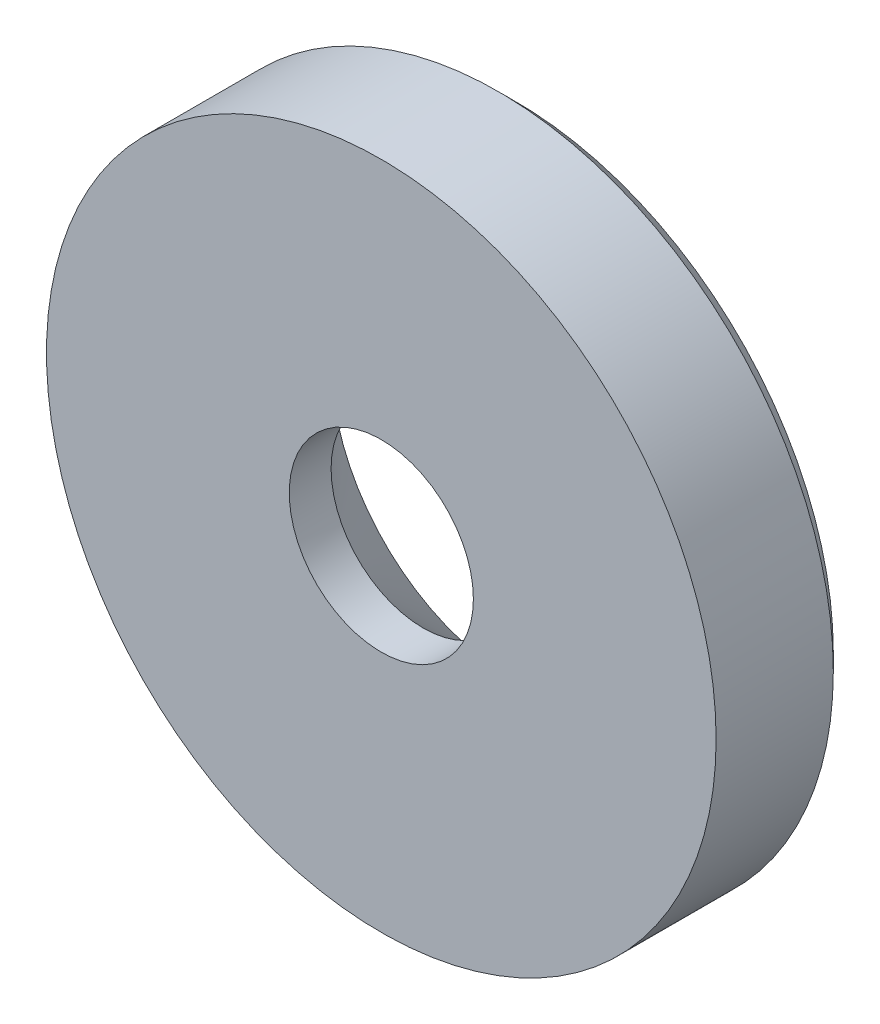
ISO-10303-21;
HEADER;
FILE_DESCRIPTION(('STEP AP214'),'2;1');
FILE_NAME('part.step','',(''),(''),'','','');
FILE_SCHEMA(('AUTOMOTIVE_DESIGN { 1 0 10303 214 1 1 1 1 }'));
ENDSEC;
DATA;
#1=APPLICATION_CONTEXT('core data for automotive mechanical design processes');
#2=APPLICATION_PROTOCOL_DEFINITION('international standard','automotive_design',2000,#1);
#3=PRODUCT_CONTEXT('',#1,'mechanical');
#4=PRODUCT('Part','Part','',(#3));
#5=PRODUCT_RELATED_PRODUCT_CATEGORY('part','',(#4));
#6=PRODUCT_DEFINITION_FORMATION('','',#4);
#7=PRODUCT_DEFINITION_CONTEXT('part definition',#1,'design');
#8=PRODUCT_DEFINITION('design','',#6,#7);
#9=PRODUCT_DEFINITION_SHAPE('','',#8);
#10=(LENGTH_UNIT() NAMED_UNIT(*) SI_UNIT(.MILLI.,.METRE.));
#11=(NAMED_UNIT(*) PLANE_ANGLE_UNIT() SI_UNIT($,.RADIAN.));
#12=(NAMED_UNIT(*) SI_UNIT($,.STERADIAN.) SOLID_ANGLE_UNIT());
#13=UNCERTAINTY_MEASURE_WITH_UNIT(LENGTH_MEASURE(1.E-05),#10,'distance_accuracy_value','');
#14=(GEOMETRIC_REPRESENTATION_CONTEXT(3) GLOBAL_UNCERTAINTY_ASSIGNED_CONTEXT((#13)) GLOBAL_UNIT_ASSIGNED_CONTEXT((#10,
#11,#12)) REPRESENTATION_CONTEXT('',''));
#15=CARTESIAN_POINT('',(0.,0.,0.));
#16=DIRECTION('',(0.,0.,1.));
#17=DIRECTION('',(1.,0.,0.));
#18=AXIS2_PLACEMENT_3D('',#15,#16,#17);
#19=CARTESIAN_POINT('',(0.,0.,-4.));
#20=DIRECTION('',(0.,0.,1.));
#21=DIRECTION('',(1.,0.,0.));
#22=AXIS2_PLACEMENT_3D('',#19,#20,#21);
#23=CYLINDRICAL_SURFACE('',#22,10.);
#24=CARTESIAN_POINT('',(0.,0.,-3.5));
#25=DIRECTION('',(0.,0.,1.));
#26=DIRECTION('',(1.,0.,0.));
#27=AXIS2_PLACEMENT_3D('',#24,#25,#26);
#28=CIRCLE('',#27,10.);
#29=CARTESIAN_POINT('',(10.,0.,-3.5));
#30=VERTEX_POINT('',#29);
#31=EDGE_CURVE('E35',#30,#30,#28,.T.);
#32=ORIENTED_EDGE('',*,*,#31,.T.);
#33=EDGE_LOOP('',(#32));
#34=FACE_BOUND('',#33,.T.);
#35=CARTESIAN_POINT('',(0.,0.,0.));
#36=DIRECTION('',(0.,0.,1.));
#37=DIRECTION('',(1.,0.,0.));
#38=AXIS2_PLACEMENT_3D('',#35,#36,#37);
#39=CIRCLE('',#38,10.);
#40=CARTESIAN_POINT('',(10.,0.,0.));
#41=VERTEX_POINT('',#40);
#42=EDGE_CURVE('E39',#41,#41,#39,.T.);
#43=ORIENTED_EDGE('',*,*,#42,.F.);
#44=EDGE_LOOP('',(#43));
#45=FACE_BOUND('',#44,.T.);
#46=ADVANCED_FACE('F28',(#34,#45),#23,.T.);
#47=CARTESIAN_POINT('',(0.,0.,-4.));
#48=DIRECTION('',(0.,0.,1.));
#49=DIRECTION('',(1.,0.,0.));
#50=AXIS2_PLACEMENT_3D('',#47,#48,#49);
#51=PLANE('',#50);
#52=CARTESIAN_POINT('',(0.,0.,-4.));
#53=DIRECTION('',(0.,0.,1.));
#54=DIRECTION('',(1.,0.,0.));
#55=AXIS2_PLACEMENT_3D('',#52,#53,#54);
#56=CIRCLE('',#55,9.5);
#57=CARTESIAN_POINT('',(9.5,0.,-4.));
#58=VERTEX_POINT('',#57);
#59=EDGE_CURVE('E10',#58,#58,#56,.F.);
#60=ORIENTED_EDGE('',*,*,#59,.T.);
#61=EDGE_LOOP('',(#60));
#62=FACE_BOUND('',#61,.T.);
#63=CARTESIAN_POINT('',(0.,0.,-4.));
#64=DIRECTION('',(0.,0.,-1.));
#65=DIRECTION('',(-1.,0.,0.));
#66=AXIS2_PLACEMENT_3D('',#63,#64,#65);
#67=CIRCLE('',#66,5.5);
#68=CARTESIAN_POINT('',(-5.5,0.,-4.));
#69=VERTEX_POINT('',#68);
#70=EDGE_CURVE('E48',#69,#69,#67,.T.);
#71=ORIENTED_EDGE('',*,*,#70,.F.);
#72=EDGE_LOOP('',(#71));
#73=FACE_BOUND('',#72,.T.);
#74=ADVANCED_FACE('F64',(#62,#73),#51,.F.);
#75=CARTESIAN_POINT('',(0.,0.,0.));
#76=DIRECTION('',(0.,0.,1.));
#77=DIRECTION('',(1.,0.,0.));
#78=AXIS2_PLACEMENT_3D('',#75,#76,#77);
#79=PLANE('',#78);
#80=CARTESIAN_POINT('',(0.,0.,0.));
#81=DIRECTION('',(0.,0.,1.));
#82=DIRECTION('',(1.,0.,0.));
#83=AXIS2_PLACEMENT_3D('',#80,#81,#82);
#84=CIRCLE('',#83,2.75);
#85=CARTESIAN_POINT('',(2.75,0.,0.));
#86=VERTEX_POINT('',#85);
#87=EDGE_CURVE('E43',#86,#86,#84,.T.);
#88=ORIENTED_EDGE('',*,*,#87,.F.);
#89=EDGE_LOOP('',(#88));
#90=FACE_BOUND('',#89,.T.);
#91=ORIENTED_EDGE('',*,*,#42,.T.);
#92=EDGE_LOOP('',(#91));
#93=FACE_BOUND('',#92,.T.);
#94=ADVANCED_FACE('F66',(#90,#93),#79,.T.);
#95=CARTESIAN_POINT('',(0.,0.,-4.));
#96=DIRECTION('',(0.,0.,1.));
#97=DIRECTION('',(1.,0.,0.));
#98=AXIS2_PLACEMENT_3D('',#95,#96,#97);
#99=CYLINDRICAL_SURFACE('',#98,2.75);
#100=CARTESIAN_POINT('',(0.,0.,-1.24999999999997));
#101=DIRECTION('',(0.,0.,-1.));
#102=DIRECTION('',(-1.,0.,0.));
#103=AXIS2_PLACEMENT_3D('',#100,#101,#102);
#104=CIRCLE('',#103,2.75);
#105=CARTESIAN_POINT('',(-2.75,0.,-1.24999999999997));
#106=VERTEX_POINT('',#105);
#107=EDGE_CURVE('E51',#106,#106,#104,.T.);
#108=ORIENTED_EDGE('',*,*,#107,.T.);
#109=EDGE_LOOP('',(#108));
#110=FACE_BOUND('',#109,.T.);
#111=ORIENTED_EDGE('',*,*,#87,.T.);
#112=EDGE_LOOP('',(#111));
#113=FACE_BOUND('',#112,.T.);
#114=ADVANCED_FACE('F55',(#110,#113),#99,.F.);
#115=CARTESIAN_POINT('',(0.,0.,-4.));
#116=DIRECTION('',(0.,0.,-1.));
#117=DIRECTION('',(-1.,0.,0.));
#118=AXIS2_PLACEMENT_3D('',#115,#116,#117);
#119=CONICAL_SURFACE('',#118,5.5,0.785398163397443);
#120=ORIENTED_EDGE('',*,*,#107,.F.);
#121=EDGE_LOOP('',(#120));
#122=FACE_BOUND('',#121,.T.);
#123=ORIENTED_EDGE('',*,*,#70,.T.);
#124=EDGE_LOOP('',(#123));
#125=FACE_BOUND('',#124,.T.);
#126=ADVANCED_FACE('F58',(#122,#125),#119,.F.);
#127=CARTESIAN_POINT('',(0.,0.,-3.5));
#128=DIRECTION('',(0.,0.,1.));
#129=DIRECTION('',(1.,0.,0.));
#130=AXIS2_PLACEMENT_3D('',#127,#128,#129);
#131=CONICAL_SURFACE('',#130,10.,0.78539816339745);
#132=ORIENTED_EDGE('',*,*,#59,.F.);
#133=EDGE_LOOP('',(#132));
#134=FACE_BOUND('',#133,.T.);
#135=ORIENTED_EDGE('',*,*,#31,.F.);
#136=EDGE_LOOP('',(#135));
#137=FACE_BOUND('',#136,.T.);
#138=ADVANCED_FACE('F30',(#134,#137),#131,.T.);
#139=CLOSED_SHELL('',(#46,#74,#94,#114,#126,#138));
#140=MANIFOLD_SOLID_BREP('B2',#139);
#141=ADVANCED_BREP_SHAPE_REPRESENTATION('',(#18,#140),#14);
#142=SHAPE_DEFINITION_REPRESENTATION(#9,#141);
ENDSEC;
END-ISO-10303-21;
